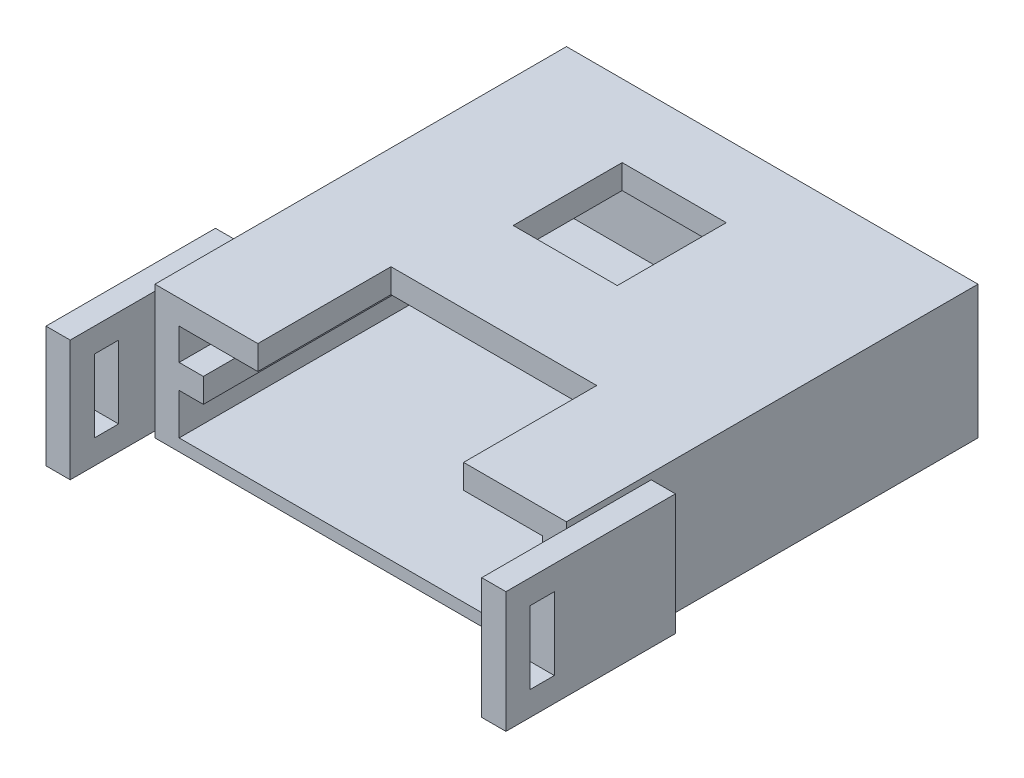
ISO-10303-21;
HEADER;
FILE_DESCRIPTION(('STEP AP214'),'2;1');
FILE_NAME('part.step','',(''),(''),'','','');
FILE_SCHEMA(('AUTOMOTIVE_DESIGN { 1 0 10303 214 1 1 1 1 }'));
ENDSEC;
DATA;
#1=APPLICATION_CONTEXT('core data for automotive mechanical design processes');
#2=APPLICATION_PROTOCOL_DEFINITION('international standard','automotive_design',2000,#1);
#3=PRODUCT_CONTEXT('',#1,'mechanical');
#4=PRODUCT('Part','Part','',(#3));
#5=PRODUCT_RELATED_PRODUCT_CATEGORY('part','',(#4));
#6=PRODUCT_DEFINITION_FORMATION('','',#4);
#7=PRODUCT_DEFINITION_CONTEXT('part definition',#1,'design');
#8=PRODUCT_DEFINITION('design','',#6,#7);
#9=PRODUCT_DEFINITION_SHAPE('','',#8);
#10=(LENGTH_UNIT() NAMED_UNIT(*) SI_UNIT(.MILLI.,.METRE.));
#11=(NAMED_UNIT(*) PLANE_ANGLE_UNIT() SI_UNIT($,.RADIAN.));
#12=(NAMED_UNIT(*) SI_UNIT($,.STERADIAN.) SOLID_ANGLE_UNIT());
#13=UNCERTAINTY_MEASURE_WITH_UNIT(LENGTH_MEASURE(1.E-05),#10,'distance_accuracy_value','');
#14=(GEOMETRIC_REPRESENTATION_CONTEXT(3) GLOBAL_UNCERTAINTY_ASSIGNED_CONTEXT((#13)) GLOBAL_UNIT_ASSIGNED_CONTEXT((#10,
#11,#12)) REPRESENTATION_CONTEXT('',''));
#15=CARTESIAN_POINT('',(0.,0.,0.));
#16=DIRECTION('',(0.,0.,1.));
#17=DIRECTION('',(1.,0.,0.));
#18=AXIS2_PLACEMENT_3D('',#15,#16,#17);
#19=CARTESIAN_POINT('',(7.5,5.5,8.));
#20=DIRECTION('',(-1.,0.,0.));
#21=DIRECTION('',(0.,0.,1.));
#22=AXIS2_PLACEMENT_3D('',#19,#20,#21);
#23=PLANE('',#22);
#24=DIRECTION('',(0.,0.,1.));
#25=VECTOR('',#24,1.);
#26=CARTESIAN_POINT('',(7.5,3.2,-9.));
#27=LINE('',#26,#25);
#28=CARTESIAN_POINT('',(7.5,3.2,-8.));
#29=VERTEX_POINT('',#28);
#30=CARTESIAN_POINT('',(7.5,3.2,8.));
#31=VERTEX_POINT('',#30);
#32=EDGE_CURVE('E483',#29,#31,#27,.T.);
#33=ORIENTED_EDGE('',*,*,#32,.T.);
#34=DIRECTION('',(0.,-1.,0.));
#35=VECTOR('',#34,1.);
#36=CARTESIAN_POINT('',(7.5,5.5,8.));
#37=LINE('',#36,#35);
#38=CARTESIAN_POINT('',(7.5,4.5,8.));
#39=VERTEX_POINT('',#38);
#40=EDGE_CURVE('E580',#39,#31,#37,.T.);
#41=ORIENTED_EDGE('',*,*,#40,.F.);
#42=DIRECTION('',(0.,0.,-1.));
#43=VECTOR('',#42,1.);
#44=CARTESIAN_POINT('',(7.5,4.5,8.));
#45=LINE('',#44,#43);
#46=CARTESIAN_POINT('',(7.5,4.5,-8.));
#47=VERTEX_POINT('',#46);
#48=EDGE_CURVE('E555',#39,#47,#45,.T.);
#49=ORIENTED_EDGE('',*,*,#48,.T.);
#50=DIRECTION('',(0.,-1.,0.));
#51=VECTOR('',#50,1.);
#52=CARTESIAN_POINT('',(7.5,5.5,-8.));
#53=LINE('',#52,#51);
#54=EDGE_CURVE('E604',#47,#29,#53,.T.);
#55=ORIENTED_EDGE('',*,*,#54,.T.);
#56=EDGE_LOOP('',(#33,#41,#49,#55));
#57=FACE_BOUND('',#56,.T.);
#58=ADVANCED_FACE('F33',(#57),#23,.T.);
#59=CARTESIAN_POINT('',(-7.5,5.5,-8.));
#60=DIRECTION('',(1.,0.,0.));
#61=DIRECTION('',(0.,0.,-1.));
#62=AXIS2_PLACEMENT_3D('',#59,#60,#61);
#63=PLANE('',#62);
#64=DIRECTION('',(0.,0.,1.));
#65=VECTOR('',#64,1.);
#66=CARTESIAN_POINT('',(-7.5,3.2,-9.));
#67=LINE('',#66,#65);
#68=CARTESIAN_POINT('',(-7.5,3.2,-8.));
#69=VERTEX_POINT('',#68);
#70=CARTESIAN_POINT('',(-7.5,3.2,8.));
#71=VERTEX_POINT('',#70);
#72=EDGE_CURVE('E505',#69,#71,#67,.T.);
#73=ORIENTED_EDGE('',*,*,#72,.F.);
#74=DIRECTION('',(0.,-1.,0.));
#75=VECTOR('',#74,1.);
#76=CARTESIAN_POINT('',(-7.5,5.5,-8.));
#77=LINE('',#76,#75);
#78=CARTESIAN_POINT('',(-7.5,4.5,-8.));
#79=VERTEX_POINT('',#78);
#80=EDGE_CURVE('E600',#79,#69,#77,.T.);
#81=ORIENTED_EDGE('',*,*,#80,.F.);
#82=DIRECTION('',(0.,0.,1.));
#83=VECTOR('',#82,1.);
#84=CARTESIAN_POINT('',(-7.5,4.5,-8.));
#85=LINE('',#84,#83);
#86=CARTESIAN_POINT('',(-7.5,4.5,8.));
#87=VERTEX_POINT('',#86);
#88=EDGE_CURVE('E553',#79,#87,#85,.T.);
#89=ORIENTED_EDGE('',*,*,#88,.T.);
#90=DIRECTION('',(0.,-1.,0.));
#91=VECTOR('',#90,1.);
#92=CARTESIAN_POINT('',(-7.5,5.5,8.));
#93=LINE('',#92,#91);
#94=EDGE_CURVE('E597',#87,#71,#93,.T.);
#95=ORIENTED_EDGE('',*,*,#94,.T.);
#96=EDGE_LOOP('',(#73,#81,#89,#95));
#97=FACE_BOUND('',#96,.T.);
#98=ADVANCED_FACE('F756',(#97),#63,.T.);
#99=DIRECTION('',(0.,0.,1.));
#100=VECTOR('',#99,1.);
#101=CARTESIAN_POINT('',(7.5,2.2,-9.));
#102=LINE('',#101,#100);
#103=CARTESIAN_POINT('',(7.5,2.2,-8.));
#104=VERTEX_POINT('',#103);
#105=CARTESIAN_POINT('',(7.5,2.2,8.));
#106=VERTEX_POINT('',#105);
#107=EDGE_CURVE('E486',#104,#106,#102,.T.);
#108=ORIENTED_EDGE('',*,*,#107,.F.);
#109=CARTESIAN_POINT('',(7.5,0.5,-8.));
#110=VERTEX_POINT('',#109);
#111=EDGE_CURVE('E572',#104,#110,#53,.T.);
#112=ORIENTED_EDGE('',*,*,#111,.T.);
#113=DIRECTION('',(0.,0.,-1.));
#114=VECTOR('',#113,1.);
#115=CARTESIAN_POINT('',(7.5,0.5,8.));
#116=LINE('',#115,#114);
#117=CARTESIAN_POINT('',(7.5,0.5,8.));
#118=VERTEX_POINT('',#117);
#119=EDGE_CURVE('E607',#118,#110,#116,.T.);
#120=ORIENTED_EDGE('',*,*,#119,.F.);
#121=EDGE_CURVE('E584',#106,#118,#37,.T.);
#122=ORIENTED_EDGE('',*,*,#121,.F.);
#123=EDGE_LOOP('',(#108,#112,#120,#122));
#124=FACE_BOUND('',#123,.T.);
#125=ADVANCED_FACE('F697',(#124),#23,.T.);
#126=DIRECTION('',(0.,0.,1.));
#127=VECTOR('',#126,1.);
#128=CARTESIAN_POINT('',(-7.5,2.2,-9.));
#129=LINE('',#128,#127);
#130=CARTESIAN_POINT('',(-7.5,2.2,-8.));
#131=VERTEX_POINT('',#130);
#132=CARTESIAN_POINT('',(-7.5,2.2,8.));
#133=VERTEX_POINT('',#132);
#134=EDGE_CURVE('E504',#131,#133,#129,.T.);
#135=ORIENTED_EDGE('',*,*,#134,.T.);
#136=CARTESIAN_POINT('',(-7.5,0.5,8.));
#137=VERTEX_POINT('',#136);
#138=EDGE_CURVE('E599',#133,#137,#93,.T.);
#139=ORIENTED_EDGE('',*,*,#138,.T.);
#140=DIRECTION('',(0.,0.,1.));
#141=VECTOR('',#140,1.);
#142=CARTESIAN_POINT('',(-7.5,0.5,8.));
#143=LINE('',#142,#141);
#144=CARTESIAN_POINT('',(-7.5,0.5,-8.));
#145=VERTEX_POINT('',#144);
#146=EDGE_CURVE('E613',#145,#137,#143,.T.);
#147=ORIENTED_EDGE('',*,*,#146,.F.);
#148=EDGE_CURVE('E603',#131,#145,#77,.T.);
#149=ORIENTED_EDGE('',*,*,#148,.F.);
#150=EDGE_LOOP('',(#135,#139,#147,#149));
#151=FACE_BOUND('',#150,.T.);
#152=ADVANCED_FACE('F700',(#151),#63,.T.);
#153=CARTESIAN_POINT('',(7.5,5.5,-8.));
#154=DIRECTION('',(0.,0.,1.));
#155=DIRECTION('',(1.,0.,0.));
#156=AXIS2_PLACEMENT_3D('',#153,#154,#155);
#157=PLANE('',#156);
#158=DIRECTION('',(-1.,0.,0.));
#159=VECTOR('',#158,1.);
#160=CARTESIAN_POINT('',(7.5,3.2,-8.));
#161=LINE('',#160,#159);
#162=CARTESIAN_POINT('',(6.5,3.2,-8.));
#163=VERTEX_POINT('',#162);
#164=EDGE_CURVE('E491',#29,#163,#161,.T.);
#165=ORIENTED_EDGE('',*,*,#164,.F.);
#166=ORIENTED_EDGE('',*,*,#54,.F.);
#167=DIRECTION('',(-1.,0.,0.));
#168=VECTOR('',#167,1.);
#169=CARTESIAN_POINT('',(7.5,4.5,-8.));
#170=LINE('',#169,#168);
#171=EDGE_CURVE('E551',#47,#79,#170,.T.);
#172=ORIENTED_EDGE('',*,*,#171,.T.);
#173=ORIENTED_EDGE('',*,*,#80,.T.);
#174=DIRECTION('',(-1.,0.,0.));
#175=VECTOR('',#174,1.);
#176=CARTESIAN_POINT('',(7.5,3.2,-8.));
#177=LINE('',#176,#175);
#178=CARTESIAN_POINT('',(-6.5,3.2,-8.));
#179=VERTEX_POINT('',#178);
#180=EDGE_CURVE('E520',#179,#69,#177,.T.);
#181=ORIENTED_EDGE('',*,*,#180,.F.);
#182=DIRECTION('',(0.,1.,0.));
#183=VECTOR('',#182,1.);
#184=CARTESIAN_POINT('',(-6.5,5.5,-8.));
#185=LINE('',#184,#183);
#186=CARTESIAN_POINT('',(-6.5,2.2,-8.));
#187=VERTEX_POINT('',#186);
#188=EDGE_CURVE('E517',#187,#179,#185,.T.);
#189=ORIENTED_EDGE('',*,*,#188,.F.);
#190=DIRECTION('',(1.,0.,0.));
#191=VECTOR('',#190,1.);
#192=CARTESIAN_POINT('',(7.5,2.2,-8.));
#193=LINE('',#192,#191);
#194=EDGE_CURVE('E508',#131,#187,#193,.T.);
#195=ORIENTED_EDGE('',*,*,#194,.F.);
#196=ORIENTED_EDGE('',*,*,#148,.T.);
#197=DIRECTION('',(-1.,0.,0.));
#198=VECTOR('',#197,1.);
#199=CARTESIAN_POINT('',(-7.5,0.5,-8.));
#200=LINE('',#199,#198);
#201=EDGE_CURVE('E610',#110,#145,#200,.T.);
#202=ORIENTED_EDGE('',*,*,#201,.F.);
#203=ORIENTED_EDGE('',*,*,#111,.F.);
#204=DIRECTION('',(1.,0.,0.));
#205=VECTOR('',#204,1.);
#206=CARTESIAN_POINT('',(7.5,2.2,-8.));
#207=LINE('',#206,#205);
#208=CARTESIAN_POINT('',(6.5,2.2,-8.));
#209=VERTEX_POINT('',#208);
#210=EDGE_CURVE('E482',#209,#104,#207,.T.);
#211=ORIENTED_EDGE('',*,*,#210,.F.);
#212=DIRECTION('',(0.,-1.,0.));
#213=VECTOR('',#212,1.);
#214=CARTESIAN_POINT('',(6.5,5.5,-8.));
#215=LINE('',#214,#213);
#216=EDGE_CURVE('E493',#163,#209,#215,.T.);
#217=ORIENTED_EDGE('',*,*,#216,.F.);
#218=EDGE_LOOP('',(#165,#166,#172,#173,#181,#189,#195,#196,#202,#203,#211,#217));
#219=FACE_BOUND('',#218,.T.);
#220=ADVANCED_FACE('F678',(#219),#157,.T.);
#221=CARTESIAN_POINT('',(-7.5,0.5,8.));
#222=DIRECTION('',(0.,0.,-1.));
#223=DIRECTION('',(-1.,0.,0.));
#224=AXIS2_PLACEMENT_3D('',#221,#222,#223);
#225=PLANE('',#224);
#226=DIRECTION('',(-1.,0.,0.));
#227=VECTOR('',#226,1.);
#228=CARTESIAN_POINT('',(8.5,5.5,8.));
#229=LINE('',#228,#227);
#230=CARTESIAN_POINT('',(8.5,5.5,8.));
#231=VERTEX_POINT('',#230);
#232=CARTESIAN_POINT('',(4.25,5.5,8.));
#233=VERTEX_POINT('',#232);
#234=EDGE_CURVE('E569',#231,#233,#229,.T.);
#235=ORIENTED_EDGE('',*,*,#234,.T.);
#236=DIRECTION('',(0.,-1.,0.));
#237=VECTOR('',#236,1.);
#238=CARTESIAN_POINT('',(4.25,0.5,8.));
#239=LINE('',#238,#237);
#240=CARTESIAN_POINT('',(4.25,4.5,8.));
#241=VERTEX_POINT('',#240);
#242=EDGE_CURVE('E544',#233,#241,#239,.T.);
#243=ORIENTED_EDGE('',*,*,#242,.T.);
#244=DIRECTION('',(1.,0.,0.));
#245=VECTOR('',#244,1.);
#246=CARTESIAN_POINT('',(8.5,4.5,8.));
#247=LINE('',#246,#245);
#248=EDGE_CURVE('E547',#241,#39,#247,.T.);
#249=ORIENTED_EDGE('',*,*,#248,.T.);
#250=ORIENTED_EDGE('',*,*,#40,.T.);
#251=DIRECTION('',(-1.,0.,0.));
#252=VECTOR('',#251,1.);
#253=CARTESIAN_POINT('',(6.5,3.2,8.));
#254=LINE('',#253,#252);
#255=CARTESIAN_POINT('',(6.5,3.2,8.));
#256=VERTEX_POINT('',#255);
#257=EDGE_CURVE('E476',#31,#256,#254,.T.);
#258=ORIENTED_EDGE('',*,*,#257,.T.);
#259=DIRECTION('',(0.,-1.,0.));
#260=VECTOR('',#259,1.);
#261=CARTESIAN_POINT('',(6.5,3.2,8.));
#262=LINE('',#261,#260);
#263=CARTESIAN_POINT('',(6.5,2.2,8.));
#264=VERTEX_POINT('',#263);
#265=EDGE_CURVE('E465',#256,#264,#262,.T.);
#266=ORIENTED_EDGE('',*,*,#265,.T.);
#267=DIRECTION('',(1.,0.,0.));
#268=VECTOR('',#267,1.);
#269=CARTESIAN_POINT('',(6.5,2.2,8.));
#270=LINE('',#269,#268);
#271=EDGE_CURVE('E474',#264,#106,#270,.T.);
#272=ORIENTED_EDGE('',*,*,#271,.T.);
#273=ORIENTED_EDGE('',*,*,#121,.T.);
#274=DIRECTION('',(1.,0.,0.));
#275=VECTOR('',#274,1.);
#276=CARTESIAN_POINT('',(-7.5,0.5,8.));
#277=LINE('',#276,#275);
#278=EDGE_CURVE('E616',#137,#118,#277,.T.);
#279=ORIENTED_EDGE('',*,*,#278,.F.);
#280=ORIENTED_EDGE('',*,*,#138,.F.);
#281=DIRECTION('',(1.,0.,0.));
#282=VECTOR('',#281,1.);
#283=CARTESIAN_POINT('',(-7.5,2.2,8.));
#284=LINE('',#283,#282);
#285=CARTESIAN_POINT('',(-6.5,2.2,8.));
#286=VERTEX_POINT('',#285);
#287=EDGE_CURVE('E495',#133,#286,#284,.T.);
#288=ORIENTED_EDGE('',*,*,#287,.T.);
#289=DIRECTION('',(0.,1.,0.));
#290=VECTOR('',#289,1.);
#291=CARTESIAN_POINT('',(-6.5,3.2,8.));
#292=LINE('',#291,#290);
#293=CARTESIAN_POINT('',(-6.5,3.2,8.));
#294=VERTEX_POINT('',#293);
#295=EDGE_CURVE('E498',#286,#294,#292,.T.);
#296=ORIENTED_EDGE('',*,*,#295,.T.);
#297=DIRECTION('',(-1.,0.,0.));
#298=VECTOR('',#297,1.);
#299=CARTESIAN_POINT('',(-7.5,3.2,8.));
#300=LINE('',#299,#298);
#301=EDGE_CURVE('E501',#294,#71,#300,.T.);
#302=ORIENTED_EDGE('',*,*,#301,.T.);
#303=ORIENTED_EDGE('',*,*,#94,.F.);
#304=CARTESIAN_POINT('',(-4.25,4.5,8.));
#305=VERTEX_POINT('',#304);
#306=EDGE_CURVE('E548',#87,#305,#247,.T.);
#307=ORIENTED_EDGE('',*,*,#306,.T.);
#308=DIRECTION('',(0.,1.,0.));
#309=VECTOR('',#308,1.);
#310=CARTESIAN_POINT('',(-4.25,0.5,8.));
#311=LINE('',#310,#309);
#312=CARTESIAN_POINT('',(-4.25,5.5,8.));
#313=VERTEX_POINT('',#312);
#314=EDGE_CURVE('E539',#305,#313,#311,.T.);
#315=ORIENTED_EDGE('',*,*,#314,.T.);
#316=CARTESIAN_POINT('',(-8.5,5.5,8.));
#317=VERTEX_POINT('',#316);
#318=EDGE_CURVE('E568',#313,#317,#229,.T.);
#319=ORIENTED_EDGE('',*,*,#318,.T.);
#320=DIRECTION('',(0.,-1.,0.));
#321=VECTOR('',#320,1.);
#322=CARTESIAN_POINT('',(-8.5,5.5,8.));
#323=LINE('',#322,#321);
#324=CARTESIAN_POINT('',(-8.5,5.25,8.));
#325=VERTEX_POINT('',#324);
#326=EDGE_CURVE('E593',#317,#325,#323,.T.);
#327=ORIENTED_EDGE('',*,*,#326,.T.);
#328=CARTESIAN_POINT('',(-8.5,0.25,8.));
#329=VERTEX_POINT('',#328);
#330=EDGE_CURVE('E596',#325,#329,#323,.T.);
#331=ORIENTED_EDGE('',*,*,#330,.T.);
#332=CARTESIAN_POINT('',(-8.5,0.,8.));
#333=VERTEX_POINT('',#332);
#334=EDGE_CURVE('E56',#329,#333,#323,.T.);
#335=ORIENTED_EDGE('',*,*,#334,.T.);
#336=DIRECTION('',(1.,0.,0.));
#337=VECTOR('',#336,1.);
#338=CARTESIAN_POINT('',(-7.5,0.,8.));
#339=LINE('',#338,#337);
#340=CARTESIAN_POINT('',(8.5,0.,8.));
#341=VERTEX_POINT('',#340);
#342=EDGE_CURVE('E583',#333,#341,#339,.T.);
#343=ORIENTED_EDGE('',*,*,#342,.T.);
#344=DIRECTION('',(0.,-1.,0.));
#345=VECTOR('',#344,1.);
#346=CARTESIAN_POINT('',(8.5,5.5,8.));
#347=LINE('',#346,#345);
#348=CARTESIAN_POINT('',(8.5,0.25,8.));
#349=VERTEX_POINT('',#348);
#350=EDGE_CURVE('E588',#349,#341,#347,.T.);
#351=ORIENTED_EDGE('',*,*,#350,.F.);
#352=CARTESIAN_POINT('',(8.5,5.25,8.));
#353=VERTEX_POINT('',#352);
#354=EDGE_CURVE('E587',#353,#349,#347,.T.);
#355=ORIENTED_EDGE('',*,*,#354,.F.);
#356=EDGE_CURVE('E585',#231,#353,#347,.T.);
#357=ORIENTED_EDGE('',*,*,#356,.F.);
#358=EDGE_LOOP('',(#235,#243,#249,#250,#258,#266,#272,#273,#279,#280,#288,#296,#302,#303,#307,
#315,#319,#327,#331,#335,#343,#351,#355,#357));
#359=FACE_BOUND('',#358,.T.);
#360=ADVANCED_FACE('F35',(#359),#225,.F.);
#361=CARTESIAN_POINT('',(0.,0.5,0.));
#362=DIRECTION('',(0.,-1.,0.));
#363=DIRECTION('',(0.,0.,-1.));
#364=AXIS2_PLACEMENT_3D('',#361,#362,#363);
#365=PLANE('',#364);
#366=ORIENTED_EDGE('',*,*,#119,.T.);
#367=ORIENTED_EDGE('',*,*,#201,.T.);
#368=ORIENTED_EDGE('',*,*,#146,.T.);
#369=ORIENTED_EDGE('',*,*,#278,.T.);
#370=EDGE_LOOP('',(#366,#367,#368,#369));
#371=FACE_BOUND('',#370,.T.);
#372=ADVANCED_FACE('F694',(#371),#365,.F.);
#373=CARTESIAN_POINT('',(0.,0.,0.));
#374=DIRECTION('',(0.,-1.,0.));
#375=DIRECTION('',(0.,0.,-1.));
#376=AXIS2_PLACEMENT_3D('',#373,#374,#375);
#377=PLANE('',#376);
#378=ORIENTED_EDGE('',*,*,#342,.F.);
#379=DIRECTION('',(0.,0.,-1.));
#380=VECTOR('',#379,1.);
#381=CARTESIAN_POINT('',(-8.5,0.,-9.));
#382=LINE('',#381,#380);
#383=CARTESIAN_POINT('',(-8.5,0.,-9.));
#384=VERTEX_POINT('',#383);
#385=EDGE_CURVE('E557',#333,#384,#382,.T.);
#386=ORIENTED_EDGE('',*,*,#385,.T.);
#387=DIRECTION('',(1.,0.,0.));
#388=VECTOR('',#387,1.);
#389=CARTESIAN_POINT('',(8.5,0.,-9.));
#390=LINE('',#389,#388);
#391=CARTESIAN_POINT('',(8.5,0.,-9.));
#392=VERTEX_POINT('',#391);
#393=EDGE_CURVE('E575',#384,#392,#390,.T.);
#394=ORIENTED_EDGE('',*,*,#393,.T.);
#395=DIRECTION('',(0.,0.,1.));
#396=VECTOR('',#395,1.);
#397=CARTESIAN_POINT('',(8.5,0.,8.));
#398=LINE('',#397,#396);
#399=EDGE_CURVE('E562',#392,#341,#398,.T.);
#400=ORIENTED_EDGE('',*,*,#399,.T.);
#401=EDGE_LOOP('',(#378,#386,#394,#400));
#402=FACE_BOUND('',#401,.T.);
#403=ADVANCED_FACE('F626',(#402),#377,.T.);
#404=CARTESIAN_POINT('',(8.5,5.5,8.));
#405=DIRECTION('',(1.,0.,0.));
#406=DIRECTION('',(0.,0.,-1.));
#407=AXIS2_PLACEMENT_3D('',#404,#405,#406);
#408=PLANE('',#407);
#409=DIRECTION('',(0.,0.,-1.));
#410=VECTOR('',#409,1.);
#411=CARTESIAN_POINT('',(8.5,0.25,11.5));
#412=LINE('',#411,#410);
#413=CARTESIAN_POINT('',(8.5,0.25,4.5));
#414=VERTEX_POINT('',#413);
#415=EDGE_CURVE('E42',#349,#414,#412,.T.);
#416=ORIENTED_EDGE('',*,*,#415,.F.);
#417=ORIENTED_EDGE('',*,*,#350,.T.);
#418=ORIENTED_EDGE('',*,*,#399,.F.);
#419=DIRECTION('',(0.,-1.,0.));
#420=VECTOR('',#419,1.);
#421=CARTESIAN_POINT('',(8.5,5.5,-9.));
#422=LINE('',#421,#420);
#423=CARTESIAN_POINT('',(8.5,5.5,-9.));
#424=VERTEX_POINT('',#423);
#425=EDGE_CURVE('E589',#424,#392,#422,.T.);
#426=ORIENTED_EDGE('',*,*,#425,.F.);
#427=DIRECTION('',(0.,0.,1.));
#428=VECTOR('',#427,1.);
#429=CARTESIAN_POINT('',(8.5,5.5,8.));
#430=LINE('',#429,#428);
#431=EDGE_CURVE('E565',#424,#231,#430,.T.);
#432=ORIENTED_EDGE('',*,*,#431,.T.);
#433=ORIENTED_EDGE('',*,*,#356,.T.);
#434=DIRECTION('',(0.,0.,1.));
#435=VECTOR('',#434,1.);
#436=CARTESIAN_POINT('',(8.5,5.25,11.5));
#437=LINE('',#436,#435);
#438=CARTESIAN_POINT('',(8.5,5.25,4.5));
#439=VERTEX_POINT('',#438);
#440=EDGE_CURVE('E421',#439,#353,#437,.T.);
#441=ORIENTED_EDGE('',*,*,#440,.F.);
#442=DIRECTION('',(0.,1.,0.));
#443=VECTOR('',#442,1.);
#444=CARTESIAN_POINT('',(8.5,0.25,4.5));
#445=LINE('',#444,#443);
#446=EDGE_CURVE('E406',#414,#439,#445,.T.);
#447=ORIENTED_EDGE('',*,*,#446,.F.);
#448=EDGE_LOOP('',(#416,#417,#418,#426,#432,#433,#441,#447));
#449=FACE_BOUND('',#448,.T.);
#450=ADVANCED_FACE('F629',(#449),#408,.T.);
#451=CARTESIAN_POINT('',(8.5,5.5,-9.));
#452=DIRECTION('',(0.,0.,-1.));
#453=DIRECTION('',(-1.,0.,0.));
#454=AXIS2_PLACEMENT_3D('',#451,#452,#453);
#455=PLANE('',#454);
#456=ORIENTED_EDGE('',*,*,#425,.T.);
#457=ORIENTED_EDGE('',*,*,#393,.F.);
#458=DIRECTION('',(0.,-1.,0.));
#459=VECTOR('',#458,1.);
#460=CARTESIAN_POINT('',(-8.5,5.5,-9.));
#461=LINE('',#460,#459);
#462=CARTESIAN_POINT('',(-8.5,5.5,-9.));
#463=VERTEX_POINT('',#462);
#464=EDGE_CURVE('E591',#463,#384,#461,.T.);
#465=ORIENTED_EDGE('',*,*,#464,.F.);
#466=DIRECTION('',(1.,0.,0.));
#467=VECTOR('',#466,1.);
#468=CARTESIAN_POINT('',(8.5,5.5,-9.));
#469=LINE('',#468,#467);
#470=EDGE_CURVE('E561',#463,#424,#469,.T.);
#471=ORIENTED_EDGE('',*,*,#470,.T.);
#472=EDGE_LOOP('',(#456,#457,#465,#471));
#473=FACE_BOUND('',#472,.T.);
#474=ADVANCED_FACE('F774',(#473),#455,.T.);
#475=CARTESIAN_POINT('',(-8.5,5.5,-9.));
#476=DIRECTION('',(-1.,0.,0.));
#477=DIRECTION('',(0.,0.,1.));
#478=AXIS2_PLACEMENT_3D('',#475,#476,#477);
#479=PLANE('',#478);
#480=DIRECTION('',(0.,0.,1.));
#481=VECTOR('',#480,1.);
#482=CARTESIAN_POINT('',(-8.5,0.25,4.5));
#483=LINE('',#482,#481);
#484=CARTESIAN_POINT('',(-8.5,0.25,4.5));
#485=VERTEX_POINT('',#484);
#486=EDGE_CURVE('E51',#485,#329,#483,.T.);
#487=ORIENTED_EDGE('',*,*,#486,.F.);
#488=DIRECTION('',(0.,-1.,0.));
#489=VECTOR('',#488,1.);
#490=CARTESIAN_POINT('',(-8.5,0.25,4.5));
#491=LINE('',#490,#489);
#492=CARTESIAN_POINT('',(-8.5,5.25,4.5));
#493=VERTEX_POINT('',#492);
#494=EDGE_CURVE('E360',#493,#485,#491,.T.);
#495=ORIENTED_EDGE('',*,*,#494,.F.);
#496=DIRECTION('',(0.,0.,-1.));
#497=VECTOR('',#496,1.);
#498=CARTESIAN_POINT('',(-8.5,5.25,4.5));
#499=LINE('',#498,#497);
#500=EDGE_CURVE('E11',#325,#493,#499,.T.);
#501=ORIENTED_EDGE('',*,*,#500,.F.);
#502=ORIENTED_EDGE('',*,*,#326,.F.);
#503=DIRECTION('',(0.,0.,-1.));
#504=VECTOR('',#503,1.);
#505=CARTESIAN_POINT('',(-8.5,5.5,-9.));
#506=LINE('',#505,#504);
#507=EDGE_CURVE('E558',#317,#463,#506,.T.);
#508=ORIENTED_EDGE('',*,*,#507,.T.);
#509=ORIENTED_EDGE('',*,*,#464,.T.);
#510=ORIENTED_EDGE('',*,*,#385,.F.);
#511=ORIENTED_EDGE('',*,*,#334,.F.);
#512=EDGE_LOOP('',(#487,#495,#501,#502,#508,#509,#510,#511));
#513=FACE_BOUND('',#512,.T.);
#514=ADVANCED_FACE('F722',(#513),#479,.T.);
#515=CARTESIAN_POINT('',(0.,5.5,0.));
#516=DIRECTION('',(0.,1.,0.));
#517=DIRECTION('',(0.,0.,1.));
#518=AXIS2_PLACEMENT_3D('',#515,#516,#517);
#519=PLANE('',#518);
#520=DIRECTION('',(0.,0.,1.));
#521=VECTOR('',#520,1.);
#522=CARTESIAN_POINT('',(-3.2,5.5,-6.));
#523=LINE('',#522,#521);
#524=CARTESIAN_POINT('',(-3.2,5.5,-6.));
#525=VERTEX_POINT('',#524);
#526=CARTESIAN_POINT('',(-3.2,5.5,-1.5));
#527=VERTEX_POINT('',#526);
#528=EDGE_CURVE('E439',#525,#527,#523,.T.);
#529=ORIENTED_EDGE('',*,*,#528,.F.);
#530=DIRECTION('',(-1.,0.,0.));
#531=VECTOR('',#530,1.);
#532=CARTESIAN_POINT('',(-3.2,5.5,-6.));
#533=LINE('',#532,#531);
#534=CARTESIAN_POINT('',(1.1,5.5,-6.));
#535=VERTEX_POINT('',#534);
#536=EDGE_CURVE('E444',#535,#525,#533,.T.);
#537=ORIENTED_EDGE('',*,*,#536,.F.);
#538=DIRECTION('',(0.,0.,-1.));
#539=VECTOR('',#538,1.);
#540=CARTESIAN_POINT('',(1.1,5.5,-6.));
#541=LINE('',#540,#539);
#542=CARTESIAN_POINT('',(1.1,5.5,-1.5));
#543=VERTEX_POINT('',#542);
#544=EDGE_CURVE('E458',#543,#535,#541,.T.);
#545=ORIENTED_EDGE('',*,*,#544,.F.);
#546=DIRECTION('',(1.,0.,0.));
#547=VECTOR('',#546,1.);
#548=CARTESIAN_POINT('',(-3.2,5.5,-1.5));
#549=LINE('',#548,#547);
#550=EDGE_CURVE('E455',#527,#543,#549,.T.);
#551=ORIENTED_EDGE('',*,*,#550,.F.);
#552=EDGE_LOOP('',(#529,#537,#545,#551));
#553=FACE_BOUND('',#552,.T.);
#554=DIRECTION('',(0.,0.,-1.));
#555=VECTOR('',#554,1.);
#556=CARTESIAN_POINT('',(4.25,5.5,13.5));
#557=LINE('',#556,#555);
#558=CARTESIAN_POINT('',(4.25,5.5,2.5));
#559=VERTEX_POINT('',#558);
#560=EDGE_CURVE('E523',#233,#559,#557,.T.);
#561=ORIENTED_EDGE('',*,*,#560,.F.);
#562=ORIENTED_EDGE('',*,*,#234,.F.);
#563=ORIENTED_EDGE('',*,*,#431,.F.);
#564=ORIENTED_EDGE('',*,*,#470,.F.);
#565=ORIENTED_EDGE('',*,*,#507,.F.);
#566=ORIENTED_EDGE('',*,*,#318,.F.);
#567=DIRECTION('',(0.,0.,1.));
#568=VECTOR('',#567,1.);
#569=CARTESIAN_POINT('',(-4.25,5.5,13.5));
#570=LINE('',#569,#568);
#571=CARTESIAN_POINT('',(-4.25,5.5,2.5));
#572=VERTEX_POINT('',#571);
#573=EDGE_CURVE('E528',#572,#313,#570,.T.);
#574=ORIENTED_EDGE('',*,*,#573,.F.);
#575=DIRECTION('',(-1.,0.,0.));
#576=VECTOR('',#575,1.);
#577=CARTESIAN_POINT('',(-4.25,5.5,2.5));
#578=LINE('',#577,#576);
#579=EDGE_CURVE('E533',#559,#572,#578,.T.);
#580=ORIENTED_EDGE('',*,*,#579,.F.);
#581=EDGE_LOOP('',(#561,#562,#563,#564,#565,#566,#574,#580));
#582=FACE_BOUND('',#581,.T.);
#583=ADVANCED_FACE('F654',(#553,#582),#519,.T.);
#584=CARTESIAN_POINT('',(0.,4.5,0.));
#585=DIRECTION('',(0.,1.,0.));
#586=DIRECTION('',(0.,0.,1.));
#587=AXIS2_PLACEMENT_3D('',#584,#585,#586);
#588=PLANE('',#587);
#589=DIRECTION('',(-1.,0.,0.));
#590=VECTOR('',#589,1.);
#591=CARTESIAN_POINT('',(-3.2,4.5,-6.));
#592=LINE('',#591,#590);
#593=CARTESIAN_POINT('',(1.1,4.5,-6.));
#594=VERTEX_POINT('',#593);
#595=CARTESIAN_POINT('',(-3.2,4.5,-6.));
#596=VERTEX_POINT('',#595);
#597=EDGE_CURVE('E450',#594,#596,#592,.T.);
#598=ORIENTED_EDGE('',*,*,#597,.T.);
#599=DIRECTION('',(0.,0.,1.));
#600=VECTOR('',#599,1.);
#601=CARTESIAN_POINT('',(-3.2,4.5,-6.));
#602=LINE('',#601,#600);
#603=CARTESIAN_POINT('',(-3.2,4.5,-1.5));
#604=VERTEX_POINT('',#603);
#605=EDGE_CURVE('E440',#596,#604,#602,.T.);
#606=ORIENTED_EDGE('',*,*,#605,.T.);
#607=DIRECTION('',(1.,0.,0.));
#608=VECTOR('',#607,1.);
#609=CARTESIAN_POINT('',(-3.2,4.5,-1.5));
#610=LINE('',#609,#608);
#611=CARTESIAN_POINT('',(1.1,4.5,-1.5));
#612=VERTEX_POINT('',#611);
#613=EDGE_CURVE('E443',#604,#612,#610,.T.);
#614=ORIENTED_EDGE('',*,*,#613,.T.);
#615=DIRECTION('',(0.,0.,-1.));
#616=VECTOR('',#615,1.);
#617=CARTESIAN_POINT('',(1.1,4.5,-6.));
#618=LINE('',#617,#616);
#619=EDGE_CURVE('E447',#612,#594,#618,.T.);
#620=ORIENTED_EDGE('',*,*,#619,.T.);
#621=EDGE_LOOP('',(#598,#606,#614,#620));
#622=FACE_BOUND('',#621,.T.);
#623=ORIENTED_EDGE('',*,*,#248,.F.);
#624=DIRECTION('',(0.,0.,-1.));
#625=VECTOR('',#624,1.);
#626=CARTESIAN_POINT('',(4.25,4.5,0.));
#627=LINE('',#626,#625);
#628=CARTESIAN_POINT('',(4.25,4.5,2.5));
#629=VERTEX_POINT('',#628);
#630=EDGE_CURVE('E37',#241,#629,#627,.T.);
#631=ORIENTED_EDGE('',*,*,#630,.T.);
#632=DIRECTION('',(-1.,0.,0.));
#633=VECTOR('',#632,1.);
#634=CARTESIAN_POINT('',(-4.25,4.5,2.5));
#635=LINE('',#634,#633);
#636=CARTESIAN_POINT('',(-4.25,4.5,2.5));
#637=VERTEX_POINT('',#636);
#638=EDGE_CURVE('E524',#629,#637,#635,.T.);
#639=ORIENTED_EDGE('',*,*,#638,.T.);
#640=DIRECTION('',(0.,0.,1.));
#641=VECTOR('',#640,1.);
#642=CARTESIAN_POINT('',(-4.25,4.5,13.5));
#643=LINE('',#642,#641);
#644=EDGE_CURVE('E527',#637,#305,#643,.T.);
#645=ORIENTED_EDGE('',*,*,#644,.T.);
#646=ORIENTED_EDGE('',*,*,#306,.F.);
#647=ORIENTED_EDGE('',*,*,#88,.F.);
#648=ORIENTED_EDGE('',*,*,#171,.F.);
#649=ORIENTED_EDGE('',*,*,#48,.F.);
#650=EDGE_LOOP('',(#623,#631,#639,#645,#646,#647,#648,#649));
#651=FACE_BOUND('',#650,.T.);
#652=ADVANCED_FACE('F666',(#622,#651),#588,.F.);
#653=CARTESIAN_POINT('',(4.25,4.5,13.5));
#654=DIRECTION('',(1.,0.,0.));
#655=DIRECTION('',(0.,0.,-1.));
#656=AXIS2_PLACEMENT_3D('',#653,#654,#655);
#657=PLANE('',#656);
#658=ORIENTED_EDGE('',*,*,#560,.T.);
#659=DIRECTION('',(0.,1.,0.));
#660=VECTOR('',#659,1.);
#661=CARTESIAN_POINT('',(4.25,4.5,2.5));
#662=LINE('',#661,#660);
#663=EDGE_CURVE('E531',#629,#559,#662,.T.);
#664=ORIENTED_EDGE('',*,*,#663,.F.);
#665=ORIENTED_EDGE('',*,*,#630,.F.);
#666=ORIENTED_EDGE('',*,*,#242,.F.);
#667=EDGE_LOOP('',(#658,#664,#665,#666));
#668=FACE_BOUND('',#667,.T.);
#669=ADVANCED_FACE('F659',(#668),#657,.F.);
#670=CARTESIAN_POINT('',(-4.25,4.5,13.5));
#671=DIRECTION('',(-1.,0.,0.));
#672=DIRECTION('',(0.,0.,1.));
#673=AXIS2_PLACEMENT_3D('',#670,#671,#672);
#674=PLANE('',#673);
#675=ORIENTED_EDGE('',*,*,#644,.F.);
#676=DIRECTION('',(0.,1.,0.));
#677=VECTOR('',#676,1.);
#678=CARTESIAN_POINT('',(-4.25,4.5,2.5));
#679=LINE('',#678,#677);
#680=EDGE_CURVE('E537',#637,#572,#679,.T.);
#681=ORIENTED_EDGE('',*,*,#680,.T.);
#682=ORIENTED_EDGE('',*,*,#573,.T.);
#683=ORIENTED_EDGE('',*,*,#314,.F.);
#684=EDGE_LOOP('',(#675,#681,#682,#683));
#685=FACE_BOUND('',#684,.T.);
#686=ADVANCED_FACE('F718',(#685),#674,.F.);
#687=CARTESIAN_POINT('',(-4.25,4.5,2.5));
#688=DIRECTION('',(0.,0.,-1.));
#689=DIRECTION('',(-1.,0.,0.));
#690=AXIS2_PLACEMENT_3D('',#687,#688,#689);
#691=PLANE('',#690);
#692=ORIENTED_EDGE('',*,*,#579,.T.);
#693=ORIENTED_EDGE('',*,*,#680,.F.);
#694=ORIENTED_EDGE('',*,*,#638,.F.);
#695=ORIENTED_EDGE('',*,*,#663,.T.);
#696=EDGE_LOOP('',(#692,#693,#694,#695));
#697=FACE_BOUND('',#696,.T.);
#698=ADVANCED_FACE('F662',(#697),#691,.F.);
#699=CARTESIAN_POINT('',(-7.5,3.2,-9.));
#700=DIRECTION('',(0.,1.,0.));
#701=DIRECTION('',(0.,0.,1.));
#702=AXIS2_PLACEMENT_3D('',#699,#700,#701);
#703=PLANE('',#702);
#704=DIRECTION('',(0.,0.,1.));
#705=VECTOR('',#704,1.);
#706=CARTESIAN_POINT('',(-6.5,3.2,-9.));
#707=LINE('',#706,#705);
#708=EDGE_CURVE('E509',#179,#294,#707,.T.);
#709=ORIENTED_EDGE('',*,*,#708,.F.);
#710=ORIENTED_EDGE('',*,*,#180,.T.);
#711=ORIENTED_EDGE('',*,*,#72,.T.);
#712=ORIENTED_EDGE('',*,*,#301,.F.);
#713=EDGE_LOOP('',(#709,#710,#711,#712));
#714=FACE_BOUND('',#713,.T.);
#715=ADVANCED_FACE('F712',(#714),#703,.T.);
#716=CARTESIAN_POINT('',(-6.5,3.2,-9.));
#717=DIRECTION('',(1.,0.,0.));
#718=DIRECTION('',(0.,0.,-1.));
#719=AXIS2_PLACEMENT_3D('',#716,#717,#718);
#720=PLANE('',#719);
#721=DIRECTION('',(0.,0.,1.));
#722=VECTOR('',#721,1.);
#723=CARTESIAN_POINT('',(-6.5,2.2,-9.));
#724=LINE('',#723,#722);
#725=EDGE_CURVE('E511',#187,#286,#724,.T.);
#726=ORIENTED_EDGE('',*,*,#725,.F.);
#727=ORIENTED_EDGE('',*,*,#188,.T.);
#728=ORIENTED_EDGE('',*,*,#708,.T.);
#729=ORIENTED_EDGE('',*,*,#295,.F.);
#730=EDGE_LOOP('',(#726,#727,#728,#729));
#731=FACE_BOUND('',#730,.T.);
#732=ADVANCED_FACE('F709',(#731),#720,.T.);
#733=CARTESIAN_POINT('',(-7.5,2.2,-9.));
#734=DIRECTION('',(0.,-1.,0.));
#735=DIRECTION('',(0.,0.,-1.));
#736=AXIS2_PLACEMENT_3D('',#733,#734,#735);
#737=PLANE('',#736);
#738=ORIENTED_EDGE('',*,*,#134,.F.);
#739=ORIENTED_EDGE('',*,*,#194,.T.);
#740=ORIENTED_EDGE('',*,*,#725,.T.);
#741=ORIENTED_EDGE('',*,*,#287,.F.);
#742=EDGE_LOOP('',(#738,#739,#740,#741));
#743=FACE_BOUND('',#742,.T.);
#744=ADVANCED_FACE('F706',(#743),#737,.T.);
#745=CARTESIAN_POINT('',(6.5,3.2,-9.));
#746=DIRECTION('',(-1.,0.,0.));
#747=DIRECTION('',(0.,-1.,0.));
#748=AXIS2_PLACEMENT_3D('',#745,#746,#747);
#749=PLANE('',#748);
#750=DIRECTION('',(0.,0.,1.));
#751=VECTOR('',#750,1.);
#752=CARTESIAN_POINT('',(6.5,3.2,-9.));
#753=LINE('',#752,#751);
#754=EDGE_CURVE('E480',#163,#256,#753,.T.);
#755=ORIENTED_EDGE('',*,*,#754,.F.);
#756=ORIENTED_EDGE('',*,*,#216,.T.);
#757=DIRECTION('',(0.,0.,1.));
#758=VECTOR('',#757,1.);
#759=CARTESIAN_POINT('',(6.5,2.2,-9.));
#760=LINE('',#759,#758);
#761=EDGE_CURVE('E479',#209,#264,#760,.T.);
#762=ORIENTED_EDGE('',*,*,#761,.T.);
#763=ORIENTED_EDGE('',*,*,#265,.F.);
#764=EDGE_LOOP('',(#755,#756,#762,#763));
#765=FACE_BOUND('',#764,.T.);
#766=ADVANCED_FACE('F683',(#765),#749,.T.);
#767=CARTESIAN_POINT('',(6.5,3.2,-9.));
#768=DIRECTION('',(0.,1.,0.));
#769=DIRECTION('',(0.,0.,1.));
#770=AXIS2_PLACEMENT_3D('',#767,#768,#769);
#771=PLANE('',#770);
#772=ORIENTED_EDGE('',*,*,#32,.F.);
#773=ORIENTED_EDGE('',*,*,#164,.T.);
#774=ORIENTED_EDGE('',*,*,#754,.T.);
#775=ORIENTED_EDGE('',*,*,#257,.F.);
#776=EDGE_LOOP('',(#772,#773,#774,#775));
#777=FACE_BOUND('',#776,.T.);
#778=ADVANCED_FACE('F674',(#777),#771,.T.);
#779=CARTESIAN_POINT('',(6.5,2.2,-9.));
#780=DIRECTION('',(0.,-1.,0.));
#781=DIRECTION('',(0.,0.,-1.));
#782=AXIS2_PLACEMENT_3D('',#779,#780,#781);
#783=PLANE('',#782);
#784=ORIENTED_EDGE('',*,*,#761,.F.);
#785=ORIENTED_EDGE('',*,*,#210,.T.);
#786=ORIENTED_EDGE('',*,*,#107,.T.);
#787=ORIENTED_EDGE('',*,*,#271,.F.);
#788=EDGE_LOOP('',(#784,#785,#786,#787));
#789=FACE_BOUND('',#788,.T.);
#790=ADVANCED_FACE('F687',(#789),#783,.T.);
#791=CARTESIAN_POINT('',(-3.2,4.5,-6.));
#792=DIRECTION('',(-1.,0.,0.));
#793=DIRECTION('',(0.,0.,1.));
#794=AXIS2_PLACEMENT_3D('',#791,#792,#793);
#795=PLANE('',#794);
#796=ORIENTED_EDGE('',*,*,#528,.T.);
#797=DIRECTION('',(0.,1.,0.));
#798=VECTOR('',#797,1.);
#799=CARTESIAN_POINT('',(-3.2,4.5,-1.5));
#800=LINE('',#799,#798);
#801=EDGE_CURVE('E453',#604,#527,#800,.T.);
#802=ORIENTED_EDGE('',*,*,#801,.F.);
#803=ORIENTED_EDGE('',*,*,#605,.F.);
#804=DIRECTION('',(0.,1.,0.));
#805=VECTOR('',#804,1.);
#806=CARTESIAN_POINT('',(-3.2,4.5,-6.));
#807=LINE('',#806,#805);
#808=EDGE_CURVE('E463',#596,#525,#807,.T.);
#809=ORIENTED_EDGE('',*,*,#808,.T.);
#810=EDGE_LOOP('',(#796,#802,#803,#809));
#811=FACE_BOUND('',#810,.T.);
#812=ADVANCED_FACE('F802',(#811),#795,.F.);
#813=CARTESIAN_POINT('',(-3.2,4.5,-6.));
#814=DIRECTION('',(0.,0.,-1.));
#815=DIRECTION('',(-1.,0.,0.));
#816=AXIS2_PLACEMENT_3D('',#813,#814,#815);
#817=PLANE('',#816);
#818=ORIENTED_EDGE('',*,*,#536,.T.);
#819=ORIENTED_EDGE('',*,*,#808,.F.);
#820=ORIENTED_EDGE('',*,*,#597,.F.);
#821=DIRECTION('',(0.,1.,0.));
#822=VECTOR('',#821,1.);
#823=CARTESIAN_POINT('',(1.1,4.5,-6.));
#824=LINE('',#823,#822);
#825=EDGE_CURVE('E466',#594,#535,#824,.T.);
#826=ORIENTED_EDGE('',*,*,#825,.T.);
#827=EDGE_LOOP('',(#818,#819,#820,#826));
#828=FACE_BOUND('',#827,.T.);
#829=ADVANCED_FACE('F807',(#828),#817,.F.);
#830=CARTESIAN_POINT('',(1.1,4.5,-6.));
#831=DIRECTION('',(1.,0.,0.));
#832=DIRECTION('',(0.,0.,-1.));
#833=AXIS2_PLACEMENT_3D('',#830,#831,#832);
#834=PLANE('',#833);
#835=ORIENTED_EDGE('',*,*,#544,.T.);
#836=ORIENTED_EDGE('',*,*,#825,.F.);
#837=ORIENTED_EDGE('',*,*,#619,.F.);
#838=DIRECTION('',(0.,1.,0.));
#839=VECTOR('',#838,1.);
#840=CARTESIAN_POINT('',(1.1,4.5,-1.5));
#841=LINE('',#840,#839);
#842=EDGE_CURVE('E468',#612,#543,#841,.T.);
#843=ORIENTED_EDGE('',*,*,#842,.T.);
#844=EDGE_LOOP('',(#835,#836,#837,#843));
#845=FACE_BOUND('',#844,.T.);
#846=ADVANCED_FACE('F813',(#845),#834,.F.);
#847=CARTESIAN_POINT('',(-3.2,4.5,-1.5));
#848=DIRECTION('',(0.,0.,1.));
#849=DIRECTION('',(1.,0.,0.));
#850=AXIS2_PLACEMENT_3D('',#847,#848,#849);
#851=PLANE('',#850);
#852=ORIENTED_EDGE('',*,*,#550,.T.);
#853=ORIENTED_EDGE('',*,*,#842,.F.);
#854=ORIENTED_EDGE('',*,*,#613,.F.);
#855=ORIENTED_EDGE('',*,*,#801,.T.);
#856=EDGE_LOOP('',(#852,#853,#854,#855));
#857=FACE_BOUND('',#856,.T.);
#858=ADVANCED_FACE('F809',(#857),#851,.F.);
#859=CARTESIAN_POINT('',(9.5,0.,0.));
#860=DIRECTION('',(-1.,0.,0.));
#861=DIRECTION('',(0.,0.,1.));
#862=AXIS2_PLACEMENT_3D('',#859,#860,#861);
#863=PLANE('',#862);
#864=DIRECTION('',(0.,1.,0.));
#865=VECTOR('',#864,1.);
#866=CARTESIAN_POINT('',(9.5,0.25,4.5));
#867=LINE('',#866,#865);
#868=CARTESIAN_POINT('',(9.5,0.25,4.5));
#869=VERTEX_POINT('',#868);
#870=CARTESIAN_POINT('',(9.5,5.25,4.5));
#871=VERTEX_POINT('',#870);
#872=EDGE_CURVE('E407',#869,#871,#867,.T.);
#873=ORIENTED_EDGE('',*,*,#872,.T.);
#874=DIRECTION('',(0.,0.,1.));
#875=VECTOR('',#874,1.);
#876=CARTESIAN_POINT('',(9.5,5.25,11.5));
#877=LINE('',#876,#875);
#878=CARTESIAN_POINT('',(9.5,5.25,11.5));
#879=VERTEX_POINT('',#878);
#880=EDGE_CURVE('E410',#871,#879,#877,.T.);
#881=ORIENTED_EDGE('',*,*,#880,.T.);
#882=DIRECTION('',(0.,-1.,0.));
#883=VECTOR('',#882,1.);
#884=CARTESIAN_POINT('',(9.5,0.25,11.5));
#885=LINE('',#884,#883);
#886=CARTESIAN_POINT('',(9.5,0.25,11.5));
#887=VERTEX_POINT('',#886);
#888=EDGE_CURVE('E413',#879,#887,#885,.T.);
#889=ORIENTED_EDGE('',*,*,#888,.T.);
#890=DIRECTION('',(0.,0.,-1.));
#891=VECTOR('',#890,1.);
#892=CARTESIAN_POINT('',(9.5,0.25,11.5));
#893=LINE('',#892,#891);
#894=EDGE_CURVE('E415',#887,#869,#893,.T.);
#895=ORIENTED_EDGE('',*,*,#894,.T.);
#896=EDGE_LOOP('',(#873,#881,#889,#895));
#897=FACE_BOUND('',#896,.T.);
#898=DIRECTION('',(0.,1.,0.));
#899=VECTOR('',#898,1.);
#900=CARTESIAN_POINT('',(9.5,1.25,9.5));
#901=LINE('',#900,#899);
#902=CARTESIAN_POINT('',(9.5,1.25,9.5));
#903=VERTEX_POINT('',#902);
#904=CARTESIAN_POINT('',(9.5,4.25,9.5));
#905=VERTEX_POINT('',#904);
#906=EDGE_CURVE('E376',#903,#905,#901,.T.);
#907=ORIENTED_EDGE('',*,*,#906,.F.);
#908=DIRECTION('',(0.,0.,-1.));
#909=VECTOR('',#908,1.);
#910=CARTESIAN_POINT('',(9.5,1.25,10.5));
#911=LINE('',#910,#909);
#912=CARTESIAN_POINT('',(9.5,1.25,10.5));
#913=VERTEX_POINT('',#912);
#914=EDGE_CURVE('E384',#913,#903,#911,.T.);
#915=ORIENTED_EDGE('',*,*,#914,.F.);
#916=DIRECTION('',(0.,-1.,0.));
#917=VECTOR('',#916,1.);
#918=CARTESIAN_POINT('',(9.5,1.25,10.5));
#919=LINE('',#918,#917);
#920=CARTESIAN_POINT('',(9.5,4.25,10.5));
#921=VERTEX_POINT('',#920);
#922=EDGE_CURVE('E381',#921,#913,#919,.T.);
#923=ORIENTED_EDGE('',*,*,#922,.F.);
#924=DIRECTION('',(0.,0.,1.));
#925=VECTOR('',#924,1.);
#926=CARTESIAN_POINT('',(9.5,4.25,10.5));
#927=LINE('',#926,#925);
#928=EDGE_CURVE('E378',#905,#921,#927,.T.);
#929=ORIENTED_EDGE('',*,*,#928,.F.);
#930=EDGE_LOOP('',(#907,#915,#923,#929));
#931=FACE_BOUND('',#930,.T.);
#932=ADVANCED_FACE('F812',(#897,#931),#863,.F.);
#933=CARTESIAN_POINT('',(8.5,0.,0.));
#934=DIRECTION('',(-1.,0.,0.));
#935=DIRECTION('',(0.,0.,1.));
#936=AXIS2_PLACEMENT_3D('',#933,#934,#935);
#937=PLANE('',#936);
#938=CARTESIAN_POINT('',(8.5,5.25,11.5));
#939=VERTEX_POINT('',#938);
#940=EDGE_CURVE('E420',#353,#939,#437,.T.);
#941=ORIENTED_EDGE('',*,*,#940,.F.);
#942=ORIENTED_EDGE('',*,*,#354,.T.);
#943=CARTESIAN_POINT('',(8.5,0.25,11.5));
#944=VERTEX_POINT('',#943);
#945=EDGE_CURVE('E411',#944,#349,#412,.T.);
#946=ORIENTED_EDGE('',*,*,#945,.F.);
#947=DIRECTION('',(0.,-1.,0.));
#948=VECTOR('',#947,1.);
#949=CARTESIAN_POINT('',(8.5,0.25,11.5));
#950=LINE('',#949,#948);
#951=EDGE_CURVE('E424',#939,#944,#950,.T.);
#952=ORIENTED_EDGE('',*,*,#951,.F.);
#953=EDGE_LOOP('',(#941,#942,#946,#952));
#954=FACE_BOUND('',#953,.T.);
#955=DIRECTION('',(0.,0.,-1.));
#956=VECTOR('',#955,1.);
#957=CARTESIAN_POINT('',(8.5,1.25,10.5));
#958=LINE('',#957,#956);
#959=CARTESIAN_POINT('',(8.5,1.25,10.5));
#960=VERTEX_POINT('',#959);
#961=CARTESIAN_POINT('',(8.5,1.25,9.5));
#962=VERTEX_POINT('',#961);
#963=EDGE_CURVE('E379',#960,#962,#958,.T.);
#964=ORIENTED_EDGE('',*,*,#963,.T.);
#965=DIRECTION('',(0.,1.,0.));
#966=VECTOR('',#965,1.);
#967=CARTESIAN_POINT('',(8.5,1.25,9.5));
#968=LINE('',#967,#966);
#969=CARTESIAN_POINT('',(8.5,4.25,9.5));
#970=VERTEX_POINT('',#969);
#971=EDGE_CURVE('E375',#962,#970,#968,.T.);
#972=ORIENTED_EDGE('',*,*,#971,.T.);
#973=DIRECTION('',(0.,0.,1.));
#974=VECTOR('',#973,1.);
#975=CARTESIAN_POINT('',(8.5,4.25,10.5));
#976=LINE('',#975,#974);
#977=CARTESIAN_POINT('',(8.5,4.25,10.5));
#978=VERTEX_POINT('',#977);
#979=EDGE_CURVE('E389',#970,#978,#976,.T.);
#980=ORIENTED_EDGE('',*,*,#979,.T.);
#981=DIRECTION('',(0.,-1.,0.));
#982=VECTOR('',#981,1.);
#983=CARTESIAN_POINT('',(8.5,1.25,10.5));
#984=LINE('',#983,#982);
#985=EDGE_CURVE('E392',#978,#960,#984,.T.);
#986=ORIENTED_EDGE('',*,*,#985,.T.);
#987=EDGE_LOOP('',(#964,#972,#980,#986));
#988=FACE_BOUND('',#987,.T.);
#989=ADVANCED_FACE('F635',(#954,#988),#937,.T.);
#990=CARTESIAN_POINT('',(9.5,0.25,4.5));
#991=DIRECTION('',(0.,0.,1.));
#992=DIRECTION('',(1.,0.,0.));
#993=AXIS2_PLACEMENT_3D('',#990,#991,#992);
#994=PLANE('',#993);
#995=ORIENTED_EDGE('',*,*,#446,.T.);
#996=DIRECTION('',(-1.,0.,0.));
#997=VECTOR('',#996,1.);
#998=CARTESIAN_POINT('',(9.5,5.25,4.5));
#999=LINE('',#998,#997);
#1000=EDGE_CURVE('E436',#871,#439,#999,.T.);
#1001=ORIENTED_EDGE('',*,*,#1000,.F.);
#1002=ORIENTED_EDGE('',*,*,#872,.F.);
#1003=DIRECTION('',(-1.,0.,0.));
#1004=VECTOR('',#1003,1.);
#1005=CARTESIAN_POINT('',(9.5,0.25,4.5));
#1006=LINE('',#1005,#1004);
#1007=EDGE_CURVE('E417',#869,#414,#1006,.T.);
#1008=ORIENTED_EDGE('',*,*,#1007,.T.);
#1009=EDGE_LOOP('',(#995,#1001,#1002,#1008));
#1010=FACE_BOUND('',#1009,.T.);
#1011=ADVANCED_FACE('F821',(#1010),#994,.F.);
#1012=CARTESIAN_POINT('',(9.5,5.25,11.5));
#1013=DIRECTION('',(0.,-1.,0.));
#1014=DIRECTION('',(0.,0.,-1.));
#1015=AXIS2_PLACEMENT_3D('',#1012,#1013,#1014);
#1016=PLANE('',#1015);
#1017=ORIENTED_EDGE('',*,*,#440,.T.);
#1018=ORIENTED_EDGE('',*,*,#940,.T.);
#1019=DIRECTION('',(-1.,0.,0.));
#1020=VECTOR('',#1019,1.);
#1021=CARTESIAN_POINT('',(9.5,5.25,11.5));
#1022=LINE('',#1021,#1020);
#1023=EDGE_CURVE('E433',#879,#939,#1022,.T.);
#1024=ORIENTED_EDGE('',*,*,#1023,.F.);
#1025=ORIENTED_EDGE('',*,*,#880,.F.);
#1026=ORIENTED_EDGE('',*,*,#1000,.T.);
#1027=EDGE_LOOP('',(#1017,#1018,#1024,#1025,#1026));
#1028=FACE_BOUND('',#1027,.T.);
#1029=ADVANCED_FACE('F648',(#1028),#1016,.F.);
#1030=CARTESIAN_POINT('',(9.5,0.25,11.5));
#1031=DIRECTION('',(0.,0.,-1.));
#1032=DIRECTION('',(-1.,0.,0.));
#1033=AXIS2_PLACEMENT_3D('',#1030,#1031,#1032);
#1034=PLANE('',#1033);
#1035=ORIENTED_EDGE('',*,*,#951,.T.);
#1036=DIRECTION('',(-1.,0.,0.));
#1037=VECTOR('',#1036,1.);
#1038=CARTESIAN_POINT('',(9.5,0.25,11.5));
#1039=LINE('',#1038,#1037);
#1040=EDGE_CURVE('E430',#887,#944,#1039,.T.);
#1041=ORIENTED_EDGE('',*,*,#1040,.F.);
#1042=ORIENTED_EDGE('',*,*,#888,.F.);
#1043=ORIENTED_EDGE('',*,*,#1023,.T.);
#1044=EDGE_LOOP('',(#1035,#1041,#1042,#1043));
#1045=FACE_BOUND('',#1044,.T.);
#1046=ADVANCED_FACE('F645',(#1045),#1034,.F.);
#1047=CARTESIAN_POINT('',(9.5,0.25,11.5));
#1048=DIRECTION('',(0.,1.,0.));
#1049=DIRECTION('',(0.,0.,1.));
#1050=AXIS2_PLACEMENT_3D('',#1047,#1048,#1049);
#1051=PLANE('',#1050);
#1052=ORIENTED_EDGE('',*,*,#945,.T.);
#1053=ORIENTED_EDGE('',*,*,#415,.T.);
#1054=ORIENTED_EDGE('',*,*,#1007,.F.);
#1055=ORIENTED_EDGE('',*,*,#894,.F.);
#1056=ORIENTED_EDGE('',*,*,#1040,.T.);
#1057=EDGE_LOOP('',(#1052,#1053,#1054,#1055,#1056));
#1058=FACE_BOUND('',#1057,.T.);
#1059=ADVANCED_FACE('F639',(#1058),#1051,.F.);
#1060=CARTESIAN_POINT('',(9.5,1.25,9.5));
#1061=DIRECTION('',(0.,0.,1.));
#1062=DIRECTION('',(1.,0.,0.));
#1063=AXIS2_PLACEMENT_3D('',#1060,#1061,#1062);
#1064=PLANE('',#1063);
#1065=ORIENTED_EDGE('',*,*,#971,.F.);
#1066=DIRECTION('',(-1.,0.,0.));
#1067=VECTOR('',#1066,1.);
#1068=CARTESIAN_POINT('',(9.5,1.25,9.5));
#1069=LINE('',#1068,#1067);
#1070=EDGE_CURVE('E386',#903,#962,#1069,.T.);
#1071=ORIENTED_EDGE('',*,*,#1070,.F.);
#1072=ORIENTED_EDGE('',*,*,#906,.T.);
#1073=DIRECTION('',(-1.,0.,0.));
#1074=VECTOR('',#1073,1.);
#1075=CARTESIAN_POINT('',(9.5,4.25,9.5));
#1076=LINE('',#1075,#1074);
#1077=EDGE_CURVE('E403',#905,#970,#1076,.T.);
#1078=ORIENTED_EDGE('',*,*,#1077,.T.);
#1079=EDGE_LOOP('',(#1065,#1071,#1072,#1078));
#1080=FACE_BOUND('',#1079,.T.);
#1081=ADVANCED_FACE('F831',(#1080),#1064,.T.);
#1082=CARTESIAN_POINT('',(9.5,4.25,10.5));
#1083=DIRECTION('',(0.,-1.,0.));
#1084=DIRECTION('',(0.,0.,-1.));
#1085=AXIS2_PLACEMENT_3D('',#1082,#1083,#1084);
#1086=PLANE('',#1085);
#1087=ORIENTED_EDGE('',*,*,#979,.F.);
#1088=ORIENTED_EDGE('',*,*,#1077,.F.);
#1089=ORIENTED_EDGE('',*,*,#928,.T.);
#1090=DIRECTION('',(-1.,0.,0.));
#1091=VECTOR('',#1090,1.);
#1092=CARTESIAN_POINT('',(9.5,4.25,10.5));
#1093=LINE('',#1092,#1091);
#1094=EDGE_CURVE('E401',#921,#978,#1093,.T.);
#1095=ORIENTED_EDGE('',*,*,#1094,.T.);
#1096=EDGE_LOOP('',(#1087,#1088,#1089,#1095));
#1097=FACE_BOUND('',#1096,.T.);
#1098=ADVANCED_FACE('F839',(#1097),#1086,.T.);
#1099=CARTESIAN_POINT('',(9.5,1.25,10.5));
#1100=DIRECTION('',(0.,0.,-1.));
#1101=DIRECTION('',(-1.,0.,0.));
#1102=AXIS2_PLACEMENT_3D('',#1099,#1100,#1101);
#1103=PLANE('',#1102);
#1104=ORIENTED_EDGE('',*,*,#985,.F.);
#1105=ORIENTED_EDGE('',*,*,#1094,.F.);
#1106=ORIENTED_EDGE('',*,*,#922,.T.);
#1107=DIRECTION('',(-1.,0.,0.));
#1108=VECTOR('',#1107,1.);
#1109=CARTESIAN_POINT('',(9.5,1.25,10.5));
#1110=LINE('',#1109,#1108);
#1111=EDGE_CURVE('E399',#913,#960,#1110,.T.);
#1112=ORIENTED_EDGE('',*,*,#1111,.T.);
#1113=EDGE_LOOP('',(#1104,#1105,#1106,#1112));
#1114=FACE_BOUND('',#1113,.T.);
#1115=ADVANCED_FACE('F843',(#1114),#1103,.T.);
#1116=CARTESIAN_POINT('',(9.5,1.25,10.5));
#1117=DIRECTION('',(0.,1.,0.));
#1118=DIRECTION('',(0.,0.,1.));
#1119=AXIS2_PLACEMENT_3D('',#1116,#1117,#1118);
#1120=PLANE('',#1119);
#1121=ORIENTED_EDGE('',*,*,#963,.F.);
#1122=ORIENTED_EDGE('',*,*,#1111,.F.);
#1123=ORIENTED_EDGE('',*,*,#914,.T.);
#1124=ORIENTED_EDGE('',*,*,#1070,.T.);
#1125=EDGE_LOOP('',(#1121,#1122,#1123,#1124));
#1126=FACE_BOUND('',#1125,.T.);
#1127=ADVANCED_FACE('F751',(#1126),#1120,.T.);
#1128=CARTESIAN_POINT('',(-8.5,0.,0.));
#1129=DIRECTION('',(1.,0.,0.));
#1130=DIRECTION('',(0.,0.,-1.));
#1131=AXIS2_PLACEMENT_3D('',#1128,#1129,#1130);
#1132=PLANE('',#1131);
#1133=DIRECTION('',(0.,0.,1.));
#1134=VECTOR('',#1133,1.);
#1135=CARTESIAN_POINT('',(-8.5,1.25,10.5));
#1136=LINE('',#1135,#1134);
#1137=CARTESIAN_POINT('',(-8.5,1.25,9.5));
#1138=VERTEX_POINT('',#1137);
#1139=CARTESIAN_POINT('',(-8.5,1.25,10.5));
#1140=VERTEX_POINT('',#1139);
#1141=EDGE_CURVE('E316',#1138,#1140,#1136,.T.);
#1142=ORIENTED_EDGE('',*,*,#1141,.T.);
#1143=DIRECTION('',(0.,1.,0.));
#1144=VECTOR('',#1143,1.);
#1145=CARTESIAN_POINT('',(-8.5,4.25,10.5));
#1146=LINE('',#1145,#1144);
#1147=CARTESIAN_POINT('',(-8.5,4.25,10.5));
#1148=VERTEX_POINT('',#1147);
#1149=EDGE_CURVE('E335',#1140,#1148,#1146,.T.);
#1150=ORIENTED_EDGE('',*,*,#1149,.T.);
#1151=DIRECTION('',(0.,0.,-1.));
#1152=VECTOR('',#1151,1.);
#1153=CARTESIAN_POINT('',(-8.5,4.25,10.5));
#1154=LINE('',#1153,#1152);
#1155=CARTESIAN_POINT('',(-8.5,4.25,9.5));
#1156=VERTEX_POINT('',#1155);
#1157=EDGE_CURVE('E322',#1148,#1156,#1154,.T.);
#1158=ORIENTED_EDGE('',*,*,#1157,.T.);
#1159=DIRECTION('',(0.,-1.,0.));
#1160=VECTOR('',#1159,1.);
#1161=CARTESIAN_POINT('',(-8.5,4.25,9.5));
#1162=LINE('',#1161,#1160);
#1163=EDGE_CURVE('E338',#1156,#1138,#1162,.T.);
#1164=ORIENTED_EDGE('',*,*,#1163,.T.);
#1165=EDGE_LOOP('',(#1142,#1150,#1158,#1164));
#1166=FACE_BOUND('',#1165,.T.);
#1167=ORIENTED_EDGE('',*,*,#330,.F.);
#1168=CARTESIAN_POINT('',(-8.5,5.25,11.5));
#1169=VERTEX_POINT('',#1168);
#1170=EDGE_CURVE('E44',#1169,#325,#499,.T.);
#1171=ORIENTED_EDGE('',*,*,#1170,.F.);
#1172=DIRECTION('',(0.,1.,0.));
#1173=VECTOR('',#1172,1.);
#1174=CARTESIAN_POINT('',(-8.5,0.25,11.5));
#1175=LINE('',#1174,#1173);
#1176=CARTESIAN_POINT('',(-8.5,0.25,11.5));
#1177=VERTEX_POINT('',#1176);
#1178=EDGE_CURVE('E323',#1177,#1169,#1175,.T.);
#1179=ORIENTED_EDGE('',*,*,#1178,.F.);
#1180=EDGE_CURVE('E362',#329,#1177,#483,.T.);
#1181=ORIENTED_EDGE('',*,*,#1180,.F.);
#1182=EDGE_LOOP('',(#1167,#1171,#1179,#1181));
#1183=FACE_BOUND('',#1182,.T.);
#1184=ADVANCED_FACE('F726',(#1166,#1183),#1132,.T.);
#1185=CARTESIAN_POINT('',(-9.5,0.,0.));
#1186=DIRECTION('',(1.,0.,0.));
#1187=DIRECTION('',(0.,0.,-1.));
#1188=AXIS2_PLACEMENT_3D('',#1185,#1186,#1187);
#1189=PLANE('',#1188);
#1190=DIRECTION('',(0.,1.,0.));
#1191=VECTOR('',#1190,1.);
#1192=CARTESIAN_POINT('',(-9.5,0.25,11.5));
#1193=LINE('',#1192,#1191);
#1194=CARTESIAN_POINT('',(-9.5,0.25,11.5));
#1195=VERTEX_POINT('',#1194);
#1196=CARTESIAN_POINT('',(-9.5,5.25,11.5));
#1197=VERTEX_POINT('',#1196);
#1198=EDGE_CURVE('E347',#1195,#1197,#1193,.T.);
#1199=ORIENTED_EDGE('',*,*,#1198,.T.);
#1200=DIRECTION('',(0.,0.,-1.));
#1201=VECTOR('',#1200,1.);
#1202=CARTESIAN_POINT('',(-9.5,5.25,4.5));
#1203=LINE('',#1202,#1201);
#1204=CARTESIAN_POINT('',(-9.5,5.25,4.5));
#1205=VERTEX_POINT('',#1204);
#1206=EDGE_CURVE('E350',#1197,#1205,#1203,.T.);
#1207=ORIENTED_EDGE('',*,*,#1206,.T.);
#1208=DIRECTION('',(0.,-1.,0.));
#1209=VECTOR('',#1208,1.);
#1210=CARTESIAN_POINT('',(-9.5,0.25,4.5));
#1211=LINE('',#1210,#1209);
#1212=CARTESIAN_POINT('',(-9.5,0.25,4.5));
#1213=VERTEX_POINT('',#1212);
#1214=EDGE_CURVE('E352',#1205,#1213,#1211,.T.);
#1215=ORIENTED_EDGE('',*,*,#1214,.T.);
#1216=DIRECTION('',(0.,0.,1.));
#1217=VECTOR('',#1216,1.);
#1218=CARTESIAN_POINT('',(-9.5,0.25,4.5));
#1219=LINE('',#1218,#1217);
#1220=EDGE_CURVE('E354',#1213,#1195,#1219,.T.);
#1221=ORIENTED_EDGE('',*,*,#1220,.T.);
#1222=EDGE_LOOP('',(#1199,#1207,#1215,#1221));
#1223=FACE_BOUND('',#1222,.T.);
#1224=DIRECTION('',(0.,1.,0.));
#1225=VECTOR('',#1224,1.);
#1226=CARTESIAN_POINT('',(-9.5,4.25,10.5));
#1227=LINE('',#1226,#1225);
#1228=CARTESIAN_POINT('',(-9.5,1.25,10.5));
#1229=VERTEX_POINT('',#1228);
#1230=CARTESIAN_POINT('',(-9.5,4.25,10.5));
#1231=VERTEX_POINT('',#1230);
#1232=EDGE_CURVE('E305',#1229,#1231,#1227,.T.);
#1233=ORIENTED_EDGE('',*,*,#1232,.F.);
#1234=DIRECTION('',(0.,0.,1.));
#1235=VECTOR('',#1234,1.);
#1236=CARTESIAN_POINT('',(-9.5,1.25,10.5));
#1237=LINE('',#1236,#1235);
#1238=CARTESIAN_POINT('',(-9.5,1.25,9.5));
#1239=VERTEX_POINT('',#1238);
#1240=EDGE_CURVE('E331',#1239,#1229,#1237,.T.);
#1241=ORIENTED_EDGE('',*,*,#1240,.F.);
#1242=DIRECTION('',(0.,-1.,0.));
#1243=VECTOR('',#1242,1.);
#1244=CARTESIAN_POINT('',(-9.5,4.25,9.5));
#1245=LINE('',#1244,#1243);
#1246=CARTESIAN_POINT('',(-9.5,4.25,9.5));
#1247=VERTEX_POINT('',#1246);
#1248=EDGE_CURVE('E329',#1247,#1239,#1245,.T.);
#1249=ORIENTED_EDGE('',*,*,#1248,.F.);
#1250=DIRECTION('',(0.,0.,-1.));
#1251=VECTOR('',#1250,1.);
#1252=CARTESIAN_POINT('',(-9.5,4.25,10.5));
#1253=LINE('',#1252,#1251);
#1254=EDGE_CURVE('E315',#1231,#1247,#1253,.T.);
#1255=ORIENTED_EDGE('',*,*,#1254,.F.);
#1256=EDGE_LOOP('',(#1233,#1241,#1249,#1255));
#1257=FACE_BOUND('',#1256,.T.);
#1258=ADVANCED_FACE('F327',(#1223,#1257),#1189,.F.);
#1259=CARTESIAN_POINT('',(-9.5,0.25,11.5));
#1260=DIRECTION('',(0.,0.,-1.));
#1261=DIRECTION('',(-1.,0.,0.));
#1262=AXIS2_PLACEMENT_3D('',#1259,#1260,#1261);
#1263=PLANE('',#1262);
#1264=ORIENTED_EDGE('',*,*,#1178,.T.);
#1265=DIRECTION('',(1.,0.,0.));
#1266=VECTOR('',#1265,1.);
#1267=CARTESIAN_POINT('',(-9.5,5.25,11.5));
#1268=LINE('',#1267,#1266);
#1269=EDGE_CURVE('E372',#1197,#1169,#1268,.T.);
#1270=ORIENTED_EDGE('',*,*,#1269,.F.);
#1271=ORIENTED_EDGE('',*,*,#1198,.F.);
#1272=DIRECTION('',(1.,0.,0.));
#1273=VECTOR('',#1272,1.);
#1274=CARTESIAN_POINT('',(-9.5,0.25,11.5));
#1275=LINE('',#1274,#1273);
#1276=EDGE_CURVE('E356',#1195,#1177,#1275,.T.);
#1277=ORIENTED_EDGE('',*,*,#1276,.T.);
#1278=EDGE_LOOP('',(#1264,#1270,#1271,#1277));
#1279=FACE_BOUND('',#1278,.T.);
#1280=ADVANCED_FACE('F734',(#1279),#1263,.F.);
#1281=CARTESIAN_POINT('',(-9.5,5.25,4.5));
#1282=DIRECTION('',(0.,-1.,0.));
#1283=DIRECTION('',(0.,0.,-1.));
#1284=AXIS2_PLACEMENT_3D('',#1281,#1282,#1283);
#1285=PLANE('',#1284);
#1286=ORIENTED_EDGE('',*,*,#1170,.T.);
#1287=ORIENTED_EDGE('',*,*,#500,.T.);
#1288=DIRECTION('',(1.,0.,0.));
#1289=VECTOR('',#1288,1.);
#1290=CARTESIAN_POINT('',(-9.5,5.25,4.5));
#1291=LINE('',#1290,#1289);
#1292=EDGE_CURVE('E369',#1205,#493,#1291,.T.);
#1293=ORIENTED_EDGE('',*,*,#1292,.F.);
#1294=ORIENTED_EDGE('',*,*,#1206,.F.);
#1295=ORIENTED_EDGE('',*,*,#1269,.T.);
#1296=EDGE_LOOP('',(#1286,#1287,#1293,#1294,#1295));
#1297=FACE_BOUND('',#1296,.T.);
#1298=ADVANCED_FACE('F729',(#1297),#1285,.F.);
#1299=CARTESIAN_POINT('',(-9.5,0.25,4.5));
#1300=DIRECTION('',(0.,0.,1.));
#1301=DIRECTION('',(1.,0.,0.));
#1302=AXIS2_PLACEMENT_3D('',#1299,#1300,#1301);
#1303=PLANE('',#1302);
#1304=ORIENTED_EDGE('',*,*,#494,.T.);
#1305=DIRECTION('',(1.,0.,0.));
#1306=VECTOR('',#1305,1.);
#1307=CARTESIAN_POINT('',(-9.5,0.25,4.5));
#1308=LINE('',#1307,#1306);
#1309=EDGE_CURVE('E366',#1213,#485,#1308,.T.);
#1310=ORIENTED_EDGE('',*,*,#1309,.F.);
#1311=ORIENTED_EDGE('',*,*,#1214,.F.);
#1312=ORIENTED_EDGE('',*,*,#1292,.T.);
#1313=EDGE_LOOP('',(#1304,#1310,#1311,#1312));
#1314=FACE_BOUND('',#1313,.T.);
#1315=ADVANCED_FACE('F742',(#1314),#1303,.F.);
#1316=CARTESIAN_POINT('',(-9.5,0.25,4.5));
#1317=DIRECTION('',(0.,1.,0.));
#1318=DIRECTION('',(0.,0.,1.));
#1319=AXIS2_PLACEMENT_3D('',#1316,#1317,#1318);
#1320=PLANE('',#1319);
#1321=ORIENTED_EDGE('',*,*,#486,.T.);
#1322=ORIENTED_EDGE('',*,*,#1180,.T.);
#1323=ORIENTED_EDGE('',*,*,#1276,.F.);
#1324=ORIENTED_EDGE('',*,*,#1220,.F.);
#1325=ORIENTED_EDGE('',*,*,#1309,.T.);
#1326=EDGE_LOOP('',(#1321,#1322,#1323,#1324,#1325));
#1327=FACE_BOUND('',#1326,.T.);
#1328=ADVANCED_FACE('F738',(#1327),#1320,.F.);
#1329=CARTESIAN_POINT('',(-9.5,4.25,10.5));
#1330=DIRECTION('',(0.,0.,-1.));
#1331=DIRECTION('',(-1.,0.,0.));
#1332=AXIS2_PLACEMENT_3D('',#1329,#1330,#1331);
#1333=PLANE('',#1332);
#1334=ORIENTED_EDGE('',*,*,#1149,.F.);
#1335=DIRECTION('',(1.,0.,0.));
#1336=VECTOR('',#1335,1.);
#1337=CARTESIAN_POINT('',(-9.5,1.25,10.5));
#1338=LINE('',#1337,#1336);
#1339=EDGE_CURVE('E311',#1229,#1140,#1338,.T.);
#1340=ORIENTED_EDGE('',*,*,#1339,.F.);
#1341=ORIENTED_EDGE('',*,*,#1232,.T.);
#1342=DIRECTION('',(1.,0.,0.));
#1343=VECTOR('',#1342,1.);
#1344=CARTESIAN_POINT('',(-9.5,4.25,10.5));
#1345=LINE('',#1344,#1343);
#1346=EDGE_CURVE('E308',#1231,#1148,#1345,.T.);
#1347=ORIENTED_EDGE('',*,*,#1346,.T.);
#1348=EDGE_LOOP('',(#1334,#1340,#1341,#1347));
#1349=FACE_BOUND('',#1348,.T.);
#1350=ADVANCED_FACE('F307',(#1349),#1333,.T.);
#1351=CARTESIAN_POINT('',(-9.5,4.25,10.5));
#1352=DIRECTION('',(0.,-1.,0.));
#1353=DIRECTION('',(0.,0.,-1.));
#1354=AXIS2_PLACEMENT_3D('',#1351,#1352,#1353);
#1355=PLANE('',#1354);
#1356=ORIENTED_EDGE('',*,*,#1157,.F.);
#1357=ORIENTED_EDGE('',*,*,#1346,.F.);
#1358=ORIENTED_EDGE('',*,*,#1254,.T.);
#1359=DIRECTION('',(1.,0.,0.));
#1360=VECTOR('',#1359,1.);
#1361=CARTESIAN_POINT('',(-9.5,4.25,9.5));
#1362=LINE('',#1361,#1360);
#1363=EDGE_CURVE('E324',#1247,#1156,#1362,.T.);
#1364=ORIENTED_EDGE('',*,*,#1363,.T.);
#1365=EDGE_LOOP('',(#1356,#1357,#1358,#1364));
#1366=FACE_BOUND('',#1365,.T.);
#1367=ADVANCED_FACE('F319',(#1366),#1355,.T.);
#1368=CARTESIAN_POINT('',(-9.5,4.25,9.5));
#1369=DIRECTION('',(0.,0.,1.));
#1370=DIRECTION('',(1.,0.,0.));
#1371=AXIS2_PLACEMENT_3D('',#1368,#1369,#1370);
#1372=PLANE('',#1371);
#1373=ORIENTED_EDGE('',*,*,#1163,.F.);
#1374=ORIENTED_EDGE('',*,*,#1363,.F.);
#1375=ORIENTED_EDGE('',*,*,#1248,.T.);
#1376=DIRECTION('',(1.,0.,0.));
#1377=VECTOR('',#1376,1.);
#1378=CARTESIAN_POINT('',(-9.5,1.25,9.5));
#1379=LINE('',#1378,#1377);
#1380=EDGE_CURVE('E344',#1239,#1138,#1379,.T.);
#1381=ORIENTED_EDGE('',*,*,#1380,.T.);
#1382=EDGE_LOOP('',(#1373,#1374,#1375,#1381));
#1383=FACE_BOUND('',#1382,.T.);
#1384=ADVANCED_FACE('F862',(#1383),#1372,.T.);
#1385=CARTESIAN_POINT('',(-9.5,1.25,10.5));
#1386=DIRECTION('',(0.,1.,0.));
#1387=DIRECTION('',(0.,0.,1.));
#1388=AXIS2_PLACEMENT_3D('',#1385,#1386,#1387);
#1389=PLANE('',#1388);
#1390=ORIENTED_EDGE('',*,*,#1141,.F.);
#1391=ORIENTED_EDGE('',*,*,#1380,.F.);
#1392=ORIENTED_EDGE('',*,*,#1240,.T.);
#1393=ORIENTED_EDGE('',*,*,#1339,.T.);
#1394=EDGE_LOOP('',(#1390,#1391,#1392,#1393));
#1395=FACE_BOUND('',#1394,.T.);
#1396=ADVANCED_FACE('F867',(#1395),#1389,.T.);
#1397=CLOSED_SHELL('',(#58,#98,#125,#152,#220,#360,#372,#403,#450,#474,#514,#583,#652,#669,#686,
#698,#715,#732,#744,#766,#778,#790,#812,#829,#846,#858,#932,#989,#1011,#1029,#1046,#1059,#1081,
#1098,#1115,#1127,#1184,#1258,#1280,#1298,#1315,#1328,#1350,#1367,#1384,#1396));
#1398=MANIFOLD_SOLID_BREP('B2',#1397);
#1399=ADVANCED_BREP_SHAPE_REPRESENTATION('',(#18,#1398),#14);
#1400=SHAPE_DEFINITION_REPRESENTATION(#9,#1399);
ENDSEC;
END-ISO-10303-21;
